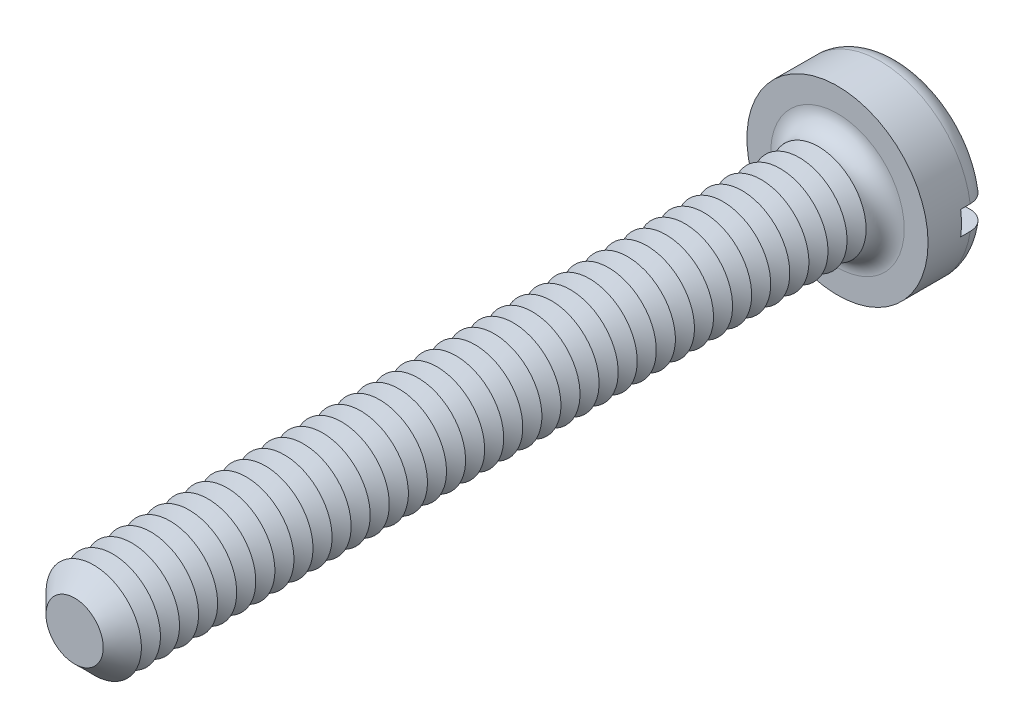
from build123d import *

# Parameters (mm, degrees)
SKETCH3_R           = 1.9
BOSS_EXTRUDE2_DEPTH = 1.3
SKETCH4_R           = 1
BOSS_EXTRUDE3_DEPTH = 16
FILLET1_R           = 0.4
CHAMFER1_SIZE       = 0.4
LPATTERN1_COUNT     = 38
LPATTERN1_PITCH     = 0.4
SKETCH8_W           = 3.8
SKETCH8_H           = 0.5
CUT_EXTRUDE1_DEPTH  = 0.6


with BuildPart() as part:
    # Sketch3 → Boss-Extrude2 (new body)
    with BuildSketch(Plane.XY):
        Circle(SKETCH3_R)
    extrude(amount=-BOSS_EXTRUDE2_DEPTH)

    # Sketch4 → Boss-Extrude3 (add)
    with BuildSketch(Plane.XY):
        Circle(SKETCH4_R)
    extrude(amount=BOSS_EXTRUDE3_DEPTH)

    # Fillet1
    fillet1_edges = [part.edges().sort_by_distance(p)[0] for p in [
        (-1.9, 0, -1.3),
        (-1, 0, 0),
    ]]
    fillet(fillet1_edges, radius=FILLET1_R)

    # Chamfer1
    chamfer1_edges = [part.edges().sort_by_distance(p)[0] for p in [
        (-1, 0, 16),
    ]]
    chamfer(chamfer1_edges, length=CHAMFER1_SIZE)

    # Sketch6 → Cut-Revolve1 (revolve, cut)
    with BuildSketch(Plane(origin=(0, 0, 0), x_dir=(0, 0, -1), z_dir=(1, 0, 0)), mode=Mode.PRIVATE) as cut_revolve1_sk:
        Polygon((-0.4, 1), (-0.6, 0.653589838), (-0.8, 1), align=None)
    cut_revolve1 = revolve(cut_revolve1_sk.sketch.rotate(Axis((0, 0, -1.694361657), (0, 0, 1)), 90), axis=Axis((0, 0, -1.694361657), (0, 0, 1)), mode=Mode.SUBTRACT)

    # LPattern1: Cut-Revolve1 ×38
    with Locations(*[(0, 0, i * LPATTERN1_PITCH) for i in range(1, LPATTERN1_COUNT)]):
        add(cut_revolve1, mode=Mode.SUBTRACT)

    # Sketch8 → Cut-Extrude1 (cut)
    with BuildSketch(Plane(origin=(0, 0, -1.3), x_dir=(-1, 0, 0), z_dir=(0, 0, -1))):
        Rectangle(SKETCH8_W, SKETCH8_H)
    extrude(amount=-CUT_EXTRUDE1_DEPTH, mode=Mode.SUBTRACT)


solid = part.part
